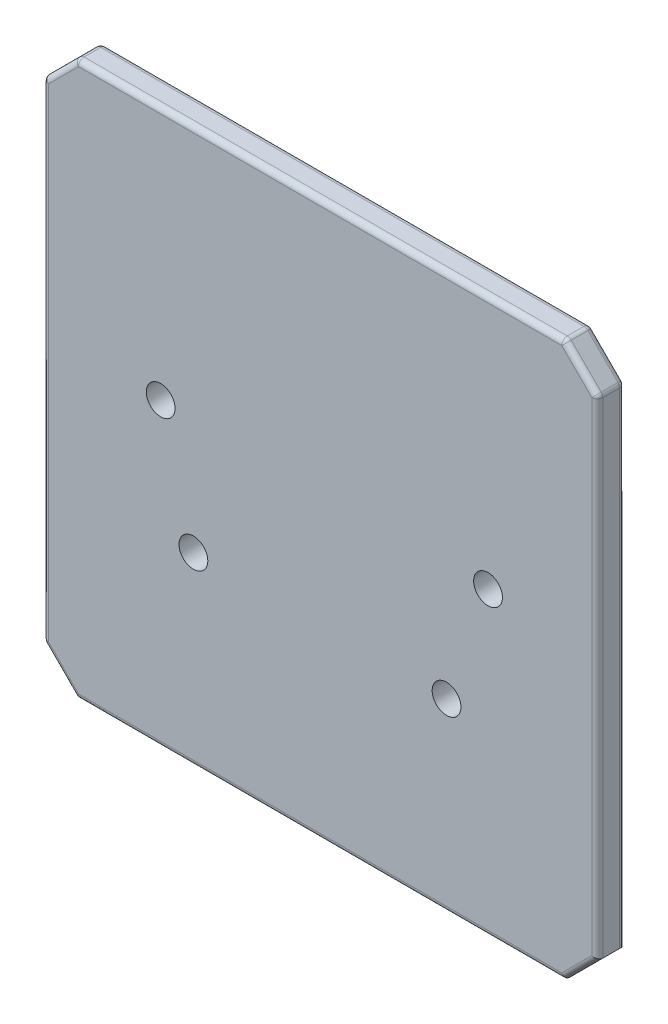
ISO-10303-21;
HEADER;
FILE_DESCRIPTION(('STEP AP214'),'2;1');
FILE_NAME('part.step','',(''),(''),'','','');
FILE_SCHEMA(('AUTOMOTIVE_DESIGN { 1 0 10303 214 1 1 1 1 }'));
ENDSEC;
DATA;
#1=APPLICATION_CONTEXT('core data for automotive mechanical design processes');
#2=APPLICATION_PROTOCOL_DEFINITION('international standard','automotive_design',2000,#1);
#3=PRODUCT_CONTEXT('',#1,'mechanical');
#4=PRODUCT('Part','Part','',(#3));
#5=PRODUCT_RELATED_PRODUCT_CATEGORY('part','',(#4));
#6=PRODUCT_DEFINITION_FORMATION('','',#4);
#7=PRODUCT_DEFINITION_CONTEXT('part definition',#1,'design');
#8=PRODUCT_DEFINITION('design','',#6,#7);
#9=PRODUCT_DEFINITION_SHAPE('','',#8);
#10=(LENGTH_UNIT() NAMED_UNIT(*) SI_UNIT(.MILLI.,.METRE.));
#11=(NAMED_UNIT(*) PLANE_ANGLE_UNIT() SI_UNIT($,.RADIAN.));
#12=(NAMED_UNIT(*) SI_UNIT($,.STERADIAN.) SOLID_ANGLE_UNIT());
#13=UNCERTAINTY_MEASURE_WITH_UNIT(LENGTH_MEASURE(1.E-05),#10,'distance_accuracy_value','');
#14=(GEOMETRIC_REPRESENTATION_CONTEXT(3) GLOBAL_UNCERTAINTY_ASSIGNED_CONTEXT((#13)) GLOBAL_UNIT_ASSIGNED_CONTEXT((#10,
#11,#12)) REPRESENTATION_CONTEXT('',''));
#15=CARTESIAN_POINT('',(0.,0.,0.));
#16=DIRECTION('',(0.,0.,1.));
#17=DIRECTION('',(1.,0.,0.));
#18=AXIS2_PLACEMENT_3D('',#15,#16,#17);
#19=CARTESIAN_POINT('',(-63.5,63.5,6.35));
#20=DIRECTION('',(0.,-1.,0.));
#21=DIRECTION('',(0.,0.,-1.));
#22=AXIS2_PLACEMENT_3D('',#19,#20,#21);
#23=PLANE('',#22);
#24=DIRECTION('',(-1.,0.,0.));
#25=VECTOR('',#24,1.);
#26=CARTESIAN_POINT('',(-63.5,63.5,1.27));
#27=LINE('',#26,#25);
#28=CARTESIAN_POINT('',(55.3539487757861,63.5,1.27));
#29=VERTEX_POINT('',#28);
#30=CARTESIAN_POINT('',(-55.3539487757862,63.5,1.27));
#31=VERTEX_POINT('',#30);
#32=EDGE_CURVE('E326',#29,#31,#27,.T.);
#33=ORIENTED_EDGE('',*,*,#32,.T.);
#34=DIRECTION('',(0.,0.,-1.));
#35=VECTOR('',#34,1.);
#36=CARTESIAN_POINT('',(-55.3539487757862,63.5,6.35));
#37=LINE('',#36,#35);
#38=CARTESIAN_POINT('',(-55.3539487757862,63.5,5.08));
#39=VERTEX_POINT('',#38);
#40=EDGE_CURVE('E332',#31,#39,#37,.F.);
#41=ORIENTED_EDGE('',*,*,#40,.T.);
#42=DIRECTION('',(-1.,0.,0.));
#43=VECTOR('',#42,1.);
#44=CARTESIAN_POINT('',(55.8799999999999,63.5,5.08));
#45=LINE('',#44,#43);
#46=CARTESIAN_POINT('',(55.3539487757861,63.5,5.08));
#47=VERTEX_POINT('',#46);
#48=EDGE_CURVE('E412',#39,#47,#45,.F.);
#49=ORIENTED_EDGE('',*,*,#48,.T.);
#50=DIRECTION('',(0.,0.,1.));
#51=VECTOR('',#50,1.);
#52=CARTESIAN_POINT('',(55.3539487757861,63.5,0.));
#53=LINE('',#52,#51);
#54=EDGE_CURVE('E334',#47,#29,#53,.F.);
#55=ORIENTED_EDGE('',*,*,#54,.T.);
#56=EDGE_LOOP('',(#33,#41,#49,#55));
#57=FACE_BOUND('',#56,.T.);
#58=ADVANCED_FACE('F33',(#57),#23,.F.);
#59=CARTESIAN_POINT('',(-63.5,-63.5,6.35));
#60=DIRECTION('',(1.,0.,0.));
#61=DIRECTION('',(0.,1.,0.));
#62=AXIS2_PLACEMENT_3D('',#59,#60,#61);
#63=PLANE('',#62);
#64=DIRECTION('',(0.,-1.,0.));
#65=VECTOR('',#64,1.);
#66=CARTESIAN_POINT('',(-63.5,55.8800000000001,5.08));
#67=LINE('',#66,#65);
#68=CARTESIAN_POINT('',(-63.5,-55.3539487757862,5.08));
#69=VERTEX_POINT('',#68);
#70=CARTESIAN_POINT('',(-63.5,55.3539487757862,5.08));
#71=VERTEX_POINT('',#70);
#72=EDGE_CURVE('E344',#69,#71,#67,.F.);
#73=ORIENTED_EDGE('',*,*,#72,.T.);
#74=DIRECTION('',(0.,0.,1.));
#75=VECTOR('',#74,1.);
#76=CARTESIAN_POINT('',(-63.5,55.3539487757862,1.27));
#77=LINE('',#76,#75);
#78=CARTESIAN_POINT('',(-63.5,55.3539487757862,1.27));
#79=VERTEX_POINT('',#78);
#80=EDGE_CURVE('E292',#71,#79,#77,.F.);
#81=ORIENTED_EDGE('',*,*,#80,.T.);
#82=DIRECTION('',(0.,-1.,0.));
#83=VECTOR('',#82,1.);
#84=CARTESIAN_POINT('',(-63.5,-63.5,1.27));
#85=LINE('',#84,#83);
#86=CARTESIAN_POINT('',(-63.5,-55.3539487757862,1.27));
#87=VERTEX_POINT('',#86);
#88=EDGE_CURVE('E352',#79,#87,#85,.T.);
#89=ORIENTED_EDGE('',*,*,#88,.T.);
#90=DIRECTION('',(0.,0.,-1.));
#91=VECTOR('',#90,1.);
#92=CARTESIAN_POINT('',(-63.5,-55.3539487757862,6.35));
#93=LINE('',#92,#91);
#94=EDGE_CURVE('E350',#87,#69,#93,.F.);
#95=ORIENTED_EDGE('',*,*,#94,.T.);
#96=EDGE_LOOP('',(#73,#81,#89,#95));
#97=FACE_BOUND('',#96,.T.);
#98=ADVANCED_FACE('F502',(#97),#63,.F.);
#99=CARTESIAN_POINT('',(-63.5,-63.5,6.35));
#100=DIRECTION('',(0.,1.,0.));
#101=DIRECTION('',(0.,0.,1.));
#102=AXIS2_PLACEMENT_3D('',#99,#100,#101);
#103=PLANE('',#102);
#104=DIRECTION('',(0.,0.,-1.));
#105=VECTOR('',#104,1.);
#106=CARTESIAN_POINT('',(-55.88,-63.5,6.35));
#107=LINE('',#106,#105);
#108=CARTESIAN_POINT('',(-55.88,-63.5,5.08));
#109=VERTEX_POINT('',#108);
#110=CARTESIAN_POINT('',(-55.88,-63.5,1.27));
#111=VERTEX_POINT('',#110);
#112=EDGE_CURVE('E198',#109,#111,#107,.T.);
#113=ORIENTED_EDGE('',*,*,#112,.T.);
#114=DIRECTION('',(1.,0.,0.));
#115=VECTOR('',#114,1.);
#116=CARTESIAN_POINT('',(-63.5,-63.5,1.27));
#117=LINE('',#116,#115);
#118=CARTESIAN_POINT('',(55.88,-63.5,1.27));
#119=VERTEX_POINT('',#118);
#120=EDGE_CURVE('E207',#111,#119,#117,.T.);
#121=ORIENTED_EDGE('',*,*,#120,.T.);
#122=DIRECTION('',(0.,0.,1.));
#123=VECTOR('',#122,1.);
#124=CARTESIAN_POINT('',(55.88,-63.5,6.35));
#125=LINE('',#124,#123);
#126=CARTESIAN_POINT('',(55.88,-63.5,5.08));
#127=VERTEX_POINT('',#126);
#128=EDGE_CURVE('E275',#119,#127,#125,.T.);
#129=ORIENTED_EDGE('',*,*,#128,.T.);
#130=DIRECTION('',(1.,0.,0.));
#131=VECTOR('',#130,1.);
#132=CARTESIAN_POINT('',(-55.88,-63.5,5.08));
#133=LINE('',#132,#131);
#134=EDGE_CURVE('E360',#127,#109,#133,.F.);
#135=ORIENTED_EDGE('',*,*,#134,.T.);
#136=EDGE_LOOP('',(#113,#121,#129,#135));
#137=FACE_BOUND('',#136,.T.);
#138=ADVANCED_FACE('F365',(#137),#103,.F.);
#139=CARTESIAN_POINT('',(63.5,-63.5,6.35));
#140=DIRECTION('',(-1.,0.,0.));
#141=DIRECTION('',(0.,-1.,0.));
#142=AXIS2_PLACEMENT_3D('',#139,#140,#141);
#143=PLANE('',#142);
#144=DIRECTION('',(0.,0.,-1.));
#145=VECTOR('',#144,1.);
#146=CARTESIAN_POINT('',(63.5,-55.88,6.35));
#147=LINE('',#146,#145);
#148=CARTESIAN_POINT('',(63.5,-55.88,5.08));
#149=VERTEX_POINT('',#148);
#150=CARTESIAN_POINT('',(63.5,-55.88,1.27));
#151=VERTEX_POINT('',#150);
#152=EDGE_CURVE('E188',#149,#151,#147,.T.);
#153=ORIENTED_EDGE('',*,*,#152,.T.);
#154=DIRECTION('',(0.,1.,0.));
#155=VECTOR('',#154,1.);
#156=CARTESIAN_POINT('',(63.5,-63.5,1.27));
#157=LINE('',#156,#155);
#158=CARTESIAN_POINT('',(63.5,55.3539487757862,1.27));
#159=VERTEX_POINT('',#158);
#160=EDGE_CURVE('E202',#151,#159,#157,.T.);
#161=ORIENTED_EDGE('',*,*,#160,.T.);
#162=DIRECTION('',(0.,0.,-1.));
#163=VECTOR('',#162,1.);
#164=CARTESIAN_POINT('',(63.5,55.3539487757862,6.35));
#165=LINE('',#164,#163);
#166=CARTESIAN_POINT('',(63.5,55.3539487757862,5.08));
#167=VERTEX_POINT('',#166);
#168=EDGE_CURVE('E394',#159,#167,#165,.F.);
#169=ORIENTED_EDGE('',*,*,#168,.T.);
#170=DIRECTION('',(0.,1.,0.));
#171=VECTOR('',#170,1.);
#172=CARTESIAN_POINT('',(63.5,-55.88,5.08));
#173=LINE('',#172,#171);
#174=EDGE_CURVE('E392',#167,#149,#173,.F.);
#175=ORIENTED_EDGE('',*,*,#174,.T.);
#176=EDGE_LOOP('',(#153,#161,#169,#175));
#177=FACE_BOUND('',#176,.T.);
#178=ADVANCED_FACE('F470',(#177),#143,.F.);
#179=CARTESIAN_POINT('',(63.5,63.5,6.35));
#180=DIRECTION('',(0.,0.,1.));
#181=DIRECTION('',(1.,0.,0.));
#182=AXIS2_PLACEMENT_3D('',#179,#180,#181);
#183=PLANE('',#182);
#184=CARTESIAN_POINT('',(-36.5368424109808,5.45243944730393,6.35));
#185=DIRECTION('',(0.,0.,1.));
#186=DIRECTION('',(1.,0.,0.));
#187=AXIS2_PLACEMENT_3D('',#184,#185,#186);
#188=CIRCLE('',#187,3.3);
#189=CARTESIAN_POINT('',(-33.2368424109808,5.45243944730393,6.35));
#190=VERTEX_POINT('',#189);
#191=EDGE_CURVE('E452',#190,#190,#188,.T.);
#192=ORIENTED_EDGE('',*,*,#191,.F.);
#193=EDGE_LOOP('',(#192));
#194=FACE_BOUND('',#193,.T.);
#195=CARTESIAN_POINT('',(38.4631575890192,5.45243944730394,6.35));
#196=DIRECTION('',(0.,0.,1.));
#197=DIRECTION('',(1.,0.,0.));
#198=AXIS2_PLACEMENT_3D('',#195,#196,#197);
#199=CIRCLE('',#198,3.3);
#200=CARTESIAN_POINT('',(41.7631575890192,5.45243944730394,6.35));
#201=VERTEX_POINT('',#200);
#202=EDGE_CURVE('E446',#201,#201,#199,.T.);
#203=ORIENTED_EDGE('',*,*,#202,.F.);
#204=EDGE_LOOP('',(#203));
#205=FACE_BOUND('',#204,.T.);
#206=CARTESIAN_POINT('',(28.9631575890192,-21.0468662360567,6.35));
#207=DIRECTION('',(0.,0.,1.));
#208=DIRECTION('',(1.,0.,0.));
#209=AXIS2_PLACEMENT_3D('',#206,#207,#208);
#210=CIRCLE('',#209,3.3);
#211=CARTESIAN_POINT('',(32.2631575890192,-21.0468662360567,6.35));
#212=VERTEX_POINT('',#211);
#213=EDGE_CURVE('E440',#212,#212,#210,.T.);
#214=ORIENTED_EDGE('',*,*,#213,.F.);
#215=EDGE_LOOP('',(#214));
#216=FACE_BOUND('',#215,.T.);
#217=CARTESIAN_POINT('',(-29.0368424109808,-21.0468662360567,6.35));
#218=DIRECTION('',(0.,0.,1.));
#219=DIRECTION('',(1.,0.,0.));
#220=AXIS2_PLACEMENT_3D('',#217,#218,#219);
#221=CIRCLE('',#220,3.3);
#222=CARTESIAN_POINT('',(-25.7368424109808,-21.0468662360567,6.35));
#223=VERTEX_POINT('',#222);
#224=EDGE_CURVE('E434',#223,#223,#221,.T.);
#225=ORIENTED_EDGE('',*,*,#224,.F.);
#226=EDGE_LOOP('',(#225));
#227=FACE_BOUND('',#226,.T.);
#228=DIRECTION('',(-1.,0.,0.));
#229=VECTOR('',#228,1.);
#230=CARTESIAN_POINT('',(-55.88,62.23,6.35));
#231=LINE('',#230,#229);
#232=CARTESIAN_POINT('',(55.3539487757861,62.23,6.35));
#233=VERTEX_POINT('',#232);
#234=CARTESIAN_POINT('',(-55.3539487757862,62.23,6.35));
#235=VERTEX_POINT('',#234);
#236=EDGE_CURVE('E409',#233,#235,#231,.T.);
#237=ORIENTED_EDGE('',*,*,#236,.T.);
#238=DIRECTION('',(0.707106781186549,0.707106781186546,0.));
#239=VECTOR('',#238,1.);
#240=CARTESIAN_POINT('',(4.70802561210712,122.291974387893,6.35));
#241=LINE('',#240,#239);
#242=CARTESIAN_POINT('',(-62.23,55.3539487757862,6.35));
#243=VERTEX_POINT('',#242);
#244=EDGE_CURVE('E282',#235,#243,#241,.F.);
#245=ORIENTED_EDGE('',*,*,#244,.T.);
#246=DIRECTION('',(0.,-1.,0.));
#247=VECTOR('',#246,1.);
#248=CARTESIAN_POINT('',(-62.23,-55.88,6.35));
#249=LINE('',#248,#247);
#250=CARTESIAN_POINT('',(-62.23,-55.3539487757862,6.35));
#251=VERTEX_POINT('',#250);
#252=EDGE_CURVE('E397',#243,#251,#249,.T.);
#253=ORIENTED_EDGE('',*,*,#252,.T.);
#254=DIRECTION('',(-0.707106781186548,0.707106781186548,0.));
#255=VECTOR('',#254,1.);
#256=CARTESIAN_POINT('',(-58.7919743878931,-58.7919743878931,6.35));
#257=LINE('',#256,#255);
#258=CARTESIAN_POINT('',(-55.3539487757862,-62.23,6.35));
#259=VERTEX_POINT('',#258);
#260=EDGE_CURVE('E399',#251,#259,#257,.F.);
#261=ORIENTED_EDGE('',*,*,#260,.T.);
#262=DIRECTION('',(1.,0.,0.));
#263=VECTOR('',#262,1.);
#264=CARTESIAN_POINT('',(55.88,-62.23,6.35));
#265=LINE('',#264,#263);
#266=CARTESIAN_POINT('',(55.3539487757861,-62.23,6.35));
#267=VERTEX_POINT('',#266);
#268=EDGE_CURVE('E401',#259,#267,#265,.T.);
#269=ORIENTED_EDGE('',*,*,#268,.T.);
#270=DIRECTION('',(-0.707106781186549,-0.707106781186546,0.));
#271=VECTOR('',#270,1.);
#272=CARTESIAN_POINT('',(122.291974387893,4.7080256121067,6.35));
#273=LINE('',#272,#271);
#274=CARTESIAN_POINT('',(62.23,-55.3539487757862,6.35));
#275=VERTEX_POINT('',#274);
#276=EDGE_CURVE('E403',#267,#275,#273,.F.);
#277=ORIENTED_EDGE('',*,*,#276,.T.);
#278=DIRECTION('',(0.,1.,0.));
#279=VECTOR('',#278,1.);
#280=CARTESIAN_POINT('',(62.23,55.88,6.35));
#281=LINE('',#280,#279);
#282=CARTESIAN_POINT('',(62.23,55.3539487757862,6.35));
#283=VERTEX_POINT('',#282);
#284=EDGE_CURVE('E405',#275,#283,#281,.T.);
#285=ORIENTED_EDGE('',*,*,#284,.T.);
#286=DIRECTION('',(0.707106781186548,-0.707106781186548,0.));
#287=VECTOR('',#286,1.);
#288=CARTESIAN_POINT('',(58.7919743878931,58.7919743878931,6.35));
#289=LINE('',#288,#287);
#290=EDGE_CURVE('E407',#283,#233,#289,.F.);
#291=ORIENTED_EDGE('',*,*,#290,.T.);
#292=EDGE_LOOP('',(#237,#245,#253,#261,#269,#277,#285,#291));
#293=FACE_BOUND('',#292,.T.);
#294=ADVANCED_FACE('F467',(#194,#205,#216,#227,#293),#183,.T.);
#295=CARTESIAN_POINT('',(63.5,63.5,0.));
#296=DIRECTION('',(0.,0.,1.));
#297=DIRECTION('',(1.,0.,0.));
#298=AXIS2_PLACEMENT_3D('',#295,#296,#297);
#299=PLANE('',#298);
#300=CARTESIAN_POINT('',(-36.5368424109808,5.45243944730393,0.));
#301=DIRECTION('',(0.,0.,1.));
#302=DIRECTION('',(1.,0.,0.));
#303=AXIS2_PLACEMENT_3D('',#300,#301,#302);
#304=CIRCLE('',#303,3.3);
#305=CARTESIAN_POINT('',(-33.2368424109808,5.45243944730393,0.));
#306=VERTEX_POINT('',#305);
#307=EDGE_CURVE('E449',#306,#306,#304,.T.);
#308=ORIENTED_EDGE('',*,*,#307,.T.);
#309=EDGE_LOOP('',(#308));
#310=FACE_BOUND('',#309,.T.);
#311=CARTESIAN_POINT('',(38.4631575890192,5.45243944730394,0.));
#312=DIRECTION('',(0.,0.,1.));
#313=DIRECTION('',(1.,0.,0.));
#314=AXIS2_PLACEMENT_3D('',#311,#312,#313);
#315=CIRCLE('',#314,3.3);
#316=CARTESIAN_POINT('',(41.7631575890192,5.45243944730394,0.));
#317=VERTEX_POINT('',#316);
#318=EDGE_CURVE('E443',#317,#317,#315,.T.);
#319=ORIENTED_EDGE('',*,*,#318,.T.);
#320=EDGE_LOOP('',(#319));
#321=FACE_BOUND('',#320,.T.);
#322=CARTESIAN_POINT('',(28.9631575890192,-21.0468662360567,0.));
#323=DIRECTION('',(0.,0.,1.));
#324=DIRECTION('',(1.,0.,0.));
#325=AXIS2_PLACEMENT_3D('',#322,#323,#324);
#326=CIRCLE('',#325,3.3);
#327=CARTESIAN_POINT('',(32.2631575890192,-21.0468662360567,0.));
#328=VERTEX_POINT('',#327);
#329=EDGE_CURVE('E437',#328,#328,#326,.T.);
#330=ORIENTED_EDGE('',*,*,#329,.T.);
#331=EDGE_LOOP('',(#330));
#332=FACE_BOUND('',#331,.T.);
#333=CARTESIAN_POINT('',(-29.0368424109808,-21.0468662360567,0.));
#334=DIRECTION('',(0.,0.,1.));
#335=DIRECTION('',(1.,0.,0.));
#336=AXIS2_PLACEMENT_3D('',#333,#334,#335);
#337=CIRCLE('',#336,3.3);
#338=CARTESIAN_POINT('',(-25.7368424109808,-21.0468662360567,0.));
#339=VERTEX_POINT('',#338);
#340=EDGE_CURVE('E300',#339,#339,#337,.T.);
#341=ORIENTED_EDGE('',*,*,#340,.T.);
#342=EDGE_LOOP('',(#341));
#343=FACE_BOUND('',#342,.T.);
#344=DIRECTION('',(0.,-1.,0.));
#345=VECTOR('',#344,1.);
#346=CARTESIAN_POINT('',(-62.23,63.5,0.));
#347=LINE('',#346,#345);
#348=CARTESIAN_POINT('',(-62.23,-55.3539487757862,0.));
#349=VERTEX_POINT('',#348);
#350=CARTESIAN_POINT('',(-62.23,55.3539487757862,0.));
#351=VERTEX_POINT('',#350);
#352=EDGE_CURVE('E377',#349,#351,#347,.F.);
#353=ORIENTED_EDGE('',*,*,#352,.T.);
#354=DIRECTION('',(-0.707106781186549,-0.707106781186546,0.));
#355=VECTOR('',#354,1.);
#356=CARTESIAN_POINT('',(-56.2519743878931,61.3319743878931,0.));
#357=LINE('',#356,#355);
#358=CARTESIAN_POINT('',(-55.3539487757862,62.23,0.));
#359=VERTEX_POINT('',#358);
#360=EDGE_CURVE('E11',#351,#359,#357,.F.);
#361=ORIENTED_EDGE('',*,*,#360,.T.);
#362=DIRECTION('',(-1.,0.,0.));
#363=VECTOR('',#362,1.);
#364=CARTESIAN_POINT('',(63.5,62.23,0.));
#365=LINE('',#364,#363);
#366=CARTESIAN_POINT('',(55.3539487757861,62.23,0.));
#367=VERTEX_POINT('',#366);
#368=EDGE_CURVE('E328',#359,#367,#365,.F.);
#369=ORIENTED_EDGE('',*,*,#368,.T.);
#370=DIRECTION('',(-0.707106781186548,0.707106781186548,0.));
#371=VECTOR('',#370,1.);
#372=CARTESIAN_POINT('',(62.6019743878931,54.9819743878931,0.));
#373=LINE('',#372,#371);
#374=CARTESIAN_POINT('',(62.23,55.3539487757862,0.));
#375=VERTEX_POINT('',#374);
#376=EDGE_CURVE('E184',#367,#375,#373,.F.);
#377=ORIENTED_EDGE('',*,*,#376,.T.);
#378=DIRECTION('',(0.,1.,0.));
#379=VECTOR('',#378,1.);
#380=CARTESIAN_POINT('',(62.23,63.5,0.));
#381=LINE('',#380,#379);
#382=CARTESIAN_POINT('',(62.23,-57.15,0.));
#383=VERTEX_POINT('',#382);
#384=EDGE_CURVE('E178',#375,#383,#381,.F.);
#385=ORIENTED_EDGE('',*,*,#384,.T.);
#386=DIRECTION('',(0.707106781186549,0.707106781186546,0.));
#387=VECTOR('',#386,1.);
#388=CARTESIAN_POINT('',(63.5,-55.88,0.));
#389=LINE('',#388,#387);
#390=CARTESIAN_POINT('',(57.15,-62.23,0.));
#391=VERTEX_POINT('',#390);
#392=EDGE_CURVE('E181',#383,#391,#389,.F.);
#393=ORIENTED_EDGE('',*,*,#392,.T.);
#394=DIRECTION('',(1.,0.,0.));
#395=VECTOR('',#394,1.);
#396=CARTESIAN_POINT('',(63.5,-62.23,0.));
#397=LINE('',#396,#395);
#398=CARTESIAN_POINT('',(-55.3539487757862,-62.23,0.));
#399=VERTEX_POINT('',#398);
#400=EDGE_CURVE('E373',#391,#399,#397,.F.);
#401=ORIENTED_EDGE('',*,*,#400,.T.);
#402=DIRECTION('',(0.707106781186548,-0.707106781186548,0.));
#403=VECTOR('',#402,1.);
#404=CARTESIAN_POINT('',(-62.6019743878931,-54.9819743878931,0.));
#405=LINE('',#404,#403);
#406=EDGE_CURVE('E375',#399,#349,#405,.F.);
#407=ORIENTED_EDGE('',*,*,#406,.T.);
#408=EDGE_LOOP('',(#353,#361,#369,#377,#385,#393,#401,#407));
#409=FACE_BOUND('',#408,.T.);
#410=ADVANCED_FACE('F180',(#310,#321,#332,#343,#409),#299,.F.);
#411=CARTESIAN_POINT('',(-55.88,-63.5,6.35));
#412=DIRECTION('',(0.707106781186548,0.707106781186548,0.));
#413=DIRECTION('',(-0.707106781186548,0.707106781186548,0.));
#414=AXIS2_PLACEMENT_3D('',#411,#412,#413);
#415=PLANE('',#414);
#416=DIRECTION('',(0.,0.,1.));
#417=VECTOR('',#416,1.);
#418=CARTESIAN_POINT('',(-63.1280256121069,-56.2519743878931,0.));
#419=LINE('',#418,#417);
#420=CARTESIAN_POINT('',(-63.1280256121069,-56.2519743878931,5.08));
#421=VERTEX_POINT('',#420);
#422=CARTESIAN_POINT('',(-63.1280256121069,-56.2519743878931,1.27));
#423=VERTEX_POINT('',#422);
#424=EDGE_CURVE('E356',#421,#423,#419,.F.);
#425=ORIENTED_EDGE('',*,*,#424,.T.);
#426=DIRECTION('',(-0.707106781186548,0.707106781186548,0.));
#427=VECTOR('',#426,1.);
#428=CARTESIAN_POINT('',(-55.88,-63.5,1.27));
#429=LINE('',#428,#427);
#430=EDGE_CURVE('E358',#423,#111,#429,.F.);
#431=ORIENTED_EDGE('',*,*,#430,.T.);
#432=ORIENTED_EDGE('',*,*,#112,.F.);
#433=DIRECTION('',(0.707106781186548,-0.707106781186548,0.));
#434=VECTOR('',#433,1.);
#435=CARTESIAN_POINT('',(-55.88,-63.5,5.08));
#436=LINE('',#435,#434);
#437=EDGE_CURVE('E354',#109,#421,#436,.F.);
#438=ORIENTED_EDGE('',*,*,#437,.T.);
#439=EDGE_LOOP('',(#425,#431,#432,#438));
#440=FACE_BOUND('',#439,.T.);
#441=ADVANCED_FACE('F511',(#440),#415,.F.);
#442=CARTESIAN_POINT('',(63.5,-55.88,6.35));
#443=DIRECTION('',(-0.707106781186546,0.707106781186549,0.));
#444=DIRECTION('',(-0.707106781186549,-0.707106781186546,0.));
#445=AXIS2_PLACEMENT_3D('',#442,#443,#444);
#446=PLANE('',#445);
#447=ORIENTED_EDGE('',*,*,#128,.F.);
#448=CARTESIAN_POINT('',(57.15,-62.23,1.27));
#449=DIRECTION('',(-0.707106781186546,0.707106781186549,0.));
#450=DIRECTION('',(0.707106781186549,0.707106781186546,0.));
#451=AXIS2_PLACEMENT_3D('',#448,#449,#450);
#452=ELLIPSE('',#451,1.79605122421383,1.27);
#453=EDGE_CURVE('E197',#119,#391,#452,.F.);
#454=ORIENTED_EDGE('',*,*,#453,.T.);
#455=ORIENTED_EDGE('',*,*,#392,.F.);
#456=CARTESIAN_POINT('',(62.23,-57.15,1.27));
#457=DIRECTION('',(-0.707106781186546,0.707106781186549,0.));
#458=DIRECTION('',(0.707106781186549,0.707106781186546,0.));
#459=AXIS2_PLACEMENT_3D('',#456,#457,#458);
#460=ELLIPSE('',#459,1.79605122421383,1.27);
#461=EDGE_CURVE('E194',#383,#151,#460,.F.);
#462=ORIENTED_EDGE('',*,*,#461,.T.);
#463=ORIENTED_EDGE('',*,*,#152,.F.);
#464=DIRECTION('',(0.707106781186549,0.707106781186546,0.));
#465=VECTOR('',#464,1.);
#466=CARTESIAN_POINT('',(63.5,-55.88,5.08));
#467=LINE('',#466,#465);
#468=EDGE_CURVE('E203',#149,#127,#467,.F.);
#469=ORIENTED_EDGE('',*,*,#468,.T.);
#470=EDGE_LOOP('',(#447,#454,#455,#462,#463,#469));
#471=FACE_BOUND('',#470,.T.);
#472=ADVANCED_FACE('F192',(#471),#446,.F.);
#473=CARTESIAN_POINT('',(55.88,63.5,6.35));
#474=DIRECTION('',(-0.707106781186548,-0.707106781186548,0.));
#475=DIRECTION('',(0.707106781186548,-0.707106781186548,0.));
#476=AXIS2_PLACEMENT_3D('',#473,#474,#475);
#477=PLANE('',#476);
#478=DIRECTION('',(0.,0.,1.));
#479=VECTOR('',#478,1.);
#480=CARTESIAN_POINT('',(63.1280256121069,56.2519743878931,0.));
#481=LINE('',#480,#479);
#482=CARTESIAN_POINT('',(63.1280256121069,56.2519743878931,5.08));
#483=VERTEX_POINT('',#482);
#484=CARTESIAN_POINT('',(63.1280256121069,56.2519743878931,1.27));
#485=VERTEX_POINT('',#484);
#486=EDGE_CURVE('E387',#483,#485,#481,.F.);
#487=ORIENTED_EDGE('',*,*,#486,.T.);
#488=DIRECTION('',(0.707106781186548,-0.707106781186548,0.));
#489=VECTOR('',#488,1.);
#490=CARTESIAN_POINT('',(55.88,63.5,1.27));
#491=LINE('',#490,#489);
#492=CARTESIAN_POINT('',(56.2519743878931,63.1280256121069,1.27));
#493=VERTEX_POINT('',#492);
#494=EDGE_CURVE('E389',#485,#493,#491,.F.);
#495=ORIENTED_EDGE('',*,*,#494,.T.);
#496=DIRECTION('',(0.,0.,-1.));
#497=VECTOR('',#496,1.);
#498=CARTESIAN_POINT('',(56.2519743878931,63.1280256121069,6.35));
#499=LINE('',#498,#497);
#500=CARTESIAN_POINT('',(56.2519743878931,63.1280256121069,5.08));
#501=VERTEX_POINT('',#500);
#502=EDGE_CURVE('E383',#493,#501,#499,.F.);
#503=ORIENTED_EDGE('',*,*,#502,.T.);
#504=DIRECTION('',(-0.707106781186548,0.707106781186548,0.));
#505=VECTOR('',#504,1.);
#506=CARTESIAN_POINT('',(55.88,63.5,5.08));
#507=LINE('',#506,#505);
#508=EDGE_CURVE('E385',#501,#483,#507,.F.);
#509=ORIENTED_EDGE('',*,*,#508,.T.);
#510=EDGE_LOOP('',(#487,#495,#503,#509));
#511=FACE_BOUND('',#510,.T.);
#512=ADVANCED_FACE('F517',(#511),#477,.F.);
#513=CARTESIAN_POINT('',(-63.5,55.8800000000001,6.35));
#514=DIRECTION('',(0.707106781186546,-0.707106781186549,0.));
#515=DIRECTION('',(0.707106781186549,0.707106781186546,0.));
#516=AXIS2_PLACEMENT_3D('',#513,#514,#515);
#517=PLANE('',#516);
#518=DIRECTION('',(0.,0.,-1.));
#519=VECTOR('',#518,1.);
#520=CARTESIAN_POINT('',(-63.1280256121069,56.2519743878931,5.08));
#521=LINE('',#520,#519);
#522=CARTESIAN_POINT('',(-63.1280256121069,56.2519743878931,1.27));
#523=VERTEX_POINT('',#522);
#524=CARTESIAN_POINT('',(-63.1280256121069,56.2519743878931,5.08));
#525=VERTEX_POINT('',#524);
#526=EDGE_CURVE('E286',#523,#525,#521,.F.);
#527=ORIENTED_EDGE('',*,*,#526,.T.);
#528=DIRECTION('',(-0.707106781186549,-0.707106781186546,0.));
#529=VECTOR('',#528,1.);
#530=CARTESIAN_POINT('',(-63.5,55.8800000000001,5.08));
#531=LINE('',#530,#529);
#532=CARTESIAN_POINT('',(-56.2519743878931,63.1280256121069,5.08));
#533=VERTEX_POINT('',#532);
#534=EDGE_CURVE('E288',#525,#533,#531,.F.);
#535=ORIENTED_EDGE('',*,*,#534,.T.);
#536=DIRECTION('',(0.,0.,1.));
#537=VECTOR('',#536,1.);
#538=CARTESIAN_POINT('',(-56.2519743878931,63.1280256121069,0.));
#539=LINE('',#538,#537);
#540=CARTESIAN_POINT('',(-56.2519743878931,63.1280256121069,1.27));
#541=VERTEX_POINT('',#540);
#542=EDGE_CURVE('E342',#533,#541,#539,.F.);
#543=ORIENTED_EDGE('',*,*,#542,.T.);
#544=DIRECTION('',(0.707106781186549,0.707106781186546,0.));
#545=VECTOR('',#544,1.);
#546=CARTESIAN_POINT('',(-62.23,57.15,1.27));
#547=LINE('',#546,#545);
#548=EDGE_CURVE('E284',#541,#523,#547,.F.);
#549=ORIENTED_EDGE('',*,*,#548,.T.);
#550=EDGE_LOOP('',(#527,#535,#543,#549));
#551=FACE_BOUND('',#550,.T.);
#552=ADVANCED_FACE('F520',(#551),#517,.F.);
#553=CARTESIAN_POINT('',(-63.5,-62.23,1.27));
#554=DIRECTION('',(1.,0.,0.));
#555=DIRECTION('',(0.,0.,-1.));
#556=AXIS2_PLACEMENT_3D('',#553,#554,#555);
#557=CYLINDRICAL_SURFACE('',#556,1.27);
#558=ORIENTED_EDGE('',*,*,#453,.F.);
#559=ORIENTED_EDGE('',*,*,#120,.F.);
#560=CARTESIAN_POINT('',(-55.3539487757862,-62.23,1.27));
#561=DIRECTION('',(0.923879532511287,-0.38268343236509,0.));
#562=DIRECTION('',(0.38268343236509,0.923879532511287,0.));
#563=AXIS2_PLACEMENT_3D('',#560,#561,#562);
#564=ELLIPSE('',#563,1.37463809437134,1.27);
#565=EDGE_CURVE('E272',#399,#111,#564,.F.);
#566=ORIENTED_EDGE('',*,*,#565,.F.);
#567=ORIENTED_EDGE('',*,*,#400,.F.);
#568=EDGE_LOOP('',(#558,#559,#566,#567));
#569=FACE_BOUND('',#568,.T.);
#570=ADVANCED_FACE('F372',(#569),#557,.T.);
#571=CARTESIAN_POINT('',(-58.7919743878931,-58.7919743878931,1.27));
#572=DIRECTION('',(-0.707106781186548,0.707106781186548,0.));
#573=DIRECTION('',(-0.707106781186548,-0.707106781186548,0.));
#574=AXIS2_PLACEMENT_3D('',#571,#572,#573);
#575=CYLINDRICAL_SURFACE('',#574,1.27);
#576=ORIENTED_EDGE('',*,*,#565,.T.);
#577=ORIENTED_EDGE('',*,*,#430,.F.);
#578=CARTESIAN_POINT('',(-62.23,-55.3539487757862,1.27));
#579=DIRECTION('',(-0.707106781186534,0.707106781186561,0.));
#580=DIRECTION('',(-0.707106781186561,-0.707106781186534,0.));
#581=AXIS2_PLACEMENT_3D('',#578,#579,#580);
#582=CIRCLE('',#581,1.27);
#583=EDGE_CURVE('E269',#349,#423,#582,.T.);
#584=ORIENTED_EDGE('',*,*,#583,.F.);
#585=ORIENTED_EDGE('',*,*,#406,.F.);
#586=EDGE_LOOP('',(#576,#577,#584,#585));
#587=FACE_BOUND('',#586,.T.);
#588=ADVANCED_FACE('F592',(#587),#575,.T.);
#589=CARTESIAN_POINT('',(-62.23,-63.5,1.27));
#590=DIRECTION('',(0.,-1.,0.));
#591=DIRECTION('',(1.,0.,0.));
#592=AXIS2_PLACEMENT_3D('',#589,#590,#591);
#593=CYLINDRICAL_SURFACE('',#592,1.27);
#594=ORIENTED_EDGE('',*,*,#88,.F.);
#595=CARTESIAN_POINT('',(-62.23,55.3539487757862,1.27));
#596=DIRECTION('',(0.,-1.,0.));
#597=DIRECTION('',(1.,0.,0.));
#598=AXIS2_PLACEMENT_3D('',#595,#596,#597);
#599=CIRCLE('',#598,1.27);
#600=EDGE_CURVE('E56',#79,#351,#599,.T.);
#601=ORIENTED_EDGE('',*,*,#600,.T.);
#602=ORIENTED_EDGE('',*,*,#352,.F.);
#603=CARTESIAN_POINT('',(-62.23,-55.3539487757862,1.27));
#604=DIRECTION('',(0.,-1.,0.));
#605=DIRECTION('',(0.,0.,-1.));
#606=AXIS2_PLACEMENT_3D('',#603,#604,#605);
#607=CIRCLE('',#606,1.27);
#608=EDGE_CURVE('E266',#87,#349,#607,.T.);
#609=ORIENTED_EDGE('',*,*,#608,.F.);
#610=EDGE_LOOP('',(#594,#601,#602,#609));
#611=FACE_BOUND('',#610,.T.);
#612=ADVANCED_FACE('F588',(#611),#593,.T.);
#613=CARTESIAN_POINT('',(-62.23,-55.3539487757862,1.27));
#614=DIRECTION('',(0.,0.,1.));
#615=DIRECTION('',(1.,0.,0.));
#616=AXIS2_PLACEMENT_3D('',#613,#614,#615);
#617=SPHERICAL_SURFACE('',#616,1.27);
#618=ORIENTED_EDGE('',*,*,#608,.T.);
#619=ORIENTED_EDGE('',*,*,#583,.T.);
#620=CARTESIAN_POINT('',(-62.23,-55.3539487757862,1.27));
#621=DIRECTION('',(0.,0.,-1.));
#622=DIRECTION('',(-1.,0.,0.));
#623=AXIS2_PLACEMENT_3D('',#620,#621,#622);
#624=CIRCLE('',#623,1.27);
#625=EDGE_CURVE('E263',#87,#423,#624,.F.);
#626=ORIENTED_EDGE('',*,*,#625,.F.);
#627=EDGE_LOOP('',(#618,#619,#626));
#628=FACE_BOUND('',#627,.T.);
#629=ADVANCED_FACE('F584',(#628),#617,.T.);
#630=CARTESIAN_POINT('',(-62.23,-55.3539487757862,6.35));
#631=DIRECTION('',(0.,0.,1.));
#632=DIRECTION('',(1.,0.,0.));
#633=AXIS2_PLACEMENT_3D('',#630,#631,#632);
#634=CYLINDRICAL_SURFACE('',#633,1.27);
#635=ORIENTED_EDGE('',*,*,#625,.T.);
#636=ORIENTED_EDGE('',*,*,#424,.F.);
#637=CARTESIAN_POINT('',(-62.23,-55.3539487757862,5.08));
#638=DIRECTION('',(0.,0.,1.));
#639=DIRECTION('',(1.,0.,0.));
#640=AXIS2_PLACEMENT_3D('',#637,#638,#639);
#641=CIRCLE('',#640,1.27);
#642=EDGE_CURVE('E260',#69,#421,#641,.T.);
#643=ORIENTED_EDGE('',*,*,#642,.F.);
#644=ORIENTED_EDGE('',*,*,#94,.F.);
#645=EDGE_LOOP('',(#635,#636,#643,#644));
#646=FACE_BOUND('',#645,.T.);
#647=ADVANCED_FACE('F580',(#646),#634,.T.);
#648=CARTESIAN_POINT('',(-62.23,63.5,5.08));
#649=DIRECTION('',(0.,1.,0.));
#650=DIRECTION('',(-1.,0.,0.));
#651=AXIS2_PLACEMENT_3D('',#648,#649,#650);
#652=CYLINDRICAL_SURFACE('',#651,1.27);
#653=ORIENTED_EDGE('',*,*,#252,.F.);
#654=CARTESIAN_POINT('',(-62.23,55.3539487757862,5.08));
#655=DIRECTION('',(0.,1.,0.));
#656=DIRECTION('',(-1.,0.,0.));
#657=AXIS2_PLACEMENT_3D('',#654,#655,#656);
#658=CIRCLE('',#657,1.27);
#659=EDGE_CURVE('E290',#243,#71,#658,.F.);
#660=ORIENTED_EDGE('',*,*,#659,.T.);
#661=ORIENTED_EDGE('',*,*,#72,.F.);
#662=CARTESIAN_POINT('',(-62.23,-55.3539487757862,5.08));
#663=DIRECTION('',(0.,-1.,0.));
#664=DIRECTION('',(1.,0.,0.));
#665=AXIS2_PLACEMENT_3D('',#662,#663,#664);
#666=CIRCLE('',#665,1.27);
#667=EDGE_CURVE('E257',#251,#69,#666,.T.);
#668=ORIENTED_EDGE('',*,*,#667,.F.);
#669=EDGE_LOOP('',(#653,#660,#661,#668));
#670=FACE_BOUND('',#669,.T.);
#671=ADVANCED_FACE('F576',(#670),#652,.T.);
#672=CARTESIAN_POINT('',(-62.23,-55.3539487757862,5.08));
#673=DIRECTION('',(0.,0.,1.));
#674=DIRECTION('',(1.,0.,0.));
#675=AXIS2_PLACEMENT_3D('',#672,#673,#674);
#676=SPHERICAL_SURFACE('',#675,1.27);
#677=ORIENTED_EDGE('',*,*,#667,.T.);
#678=ORIENTED_EDGE('',*,*,#642,.T.);
#679=CARTESIAN_POINT('',(-62.23,-55.3539487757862,5.08));
#680=DIRECTION('',(-0.707106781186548,0.707106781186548,0.));
#681=DIRECTION('',(-0.707106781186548,-0.707106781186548,0.));
#682=AXIS2_PLACEMENT_3D('',#679,#680,#681);
#683=CIRCLE('',#682,1.27);
#684=EDGE_CURVE('E254',#251,#421,#683,.F.);
#685=ORIENTED_EDGE('',*,*,#684,.F.);
#686=EDGE_LOOP('',(#677,#678,#685));
#687=FACE_BOUND('',#686,.T.);
#688=ADVANCED_FACE('F572',(#687),#676,.T.);
#689=CARTESIAN_POINT('',(-58.7919743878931,-58.7919743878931,5.08));
#690=DIRECTION('',(-0.707106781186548,0.707106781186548,0.));
#691=DIRECTION('',(-0.707106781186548,-0.707106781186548,0.));
#692=AXIS2_PLACEMENT_3D('',#689,#690,#691);
#693=CYLINDRICAL_SURFACE('',#692,1.27);
#694=ORIENTED_EDGE('',*,*,#684,.T.);
#695=ORIENTED_EDGE('',*,*,#437,.F.);
#696=CARTESIAN_POINT('',(-55.3539487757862,-62.23,5.08));
#697=DIRECTION('',(-0.923879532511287,0.38268343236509,0.));
#698=DIRECTION('',(0.38268343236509,0.923879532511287,0.));
#699=AXIS2_PLACEMENT_3D('',#696,#697,#698);
#700=ELLIPSE('',#699,1.37463809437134,1.27);
#701=EDGE_CURVE('E251',#259,#109,#700,.F.);
#702=ORIENTED_EDGE('',*,*,#701,.F.);
#703=ORIENTED_EDGE('',*,*,#260,.F.);
#704=EDGE_LOOP('',(#694,#695,#702,#703));
#705=FACE_BOUND('',#704,.T.);
#706=ADVANCED_FACE('F568',(#705),#693,.T.);
#707=CARTESIAN_POINT('',(63.5,-62.23,5.08));
#708=DIRECTION('',(-1.,0.,0.));
#709=DIRECTION('',(0.,0.,1.));
#710=AXIS2_PLACEMENT_3D('',#707,#708,#709);
#711=CYLINDRICAL_SURFACE('',#710,1.27);
#712=ORIENTED_EDGE('',*,*,#701,.T.);
#713=ORIENTED_EDGE('',*,*,#134,.F.);
#714=CARTESIAN_POINT('',(55.3539487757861,-62.23,5.08));
#715=DIRECTION('',(-0.923879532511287,-0.382683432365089,0.));
#716=DIRECTION('',(-0.382683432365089,0.923879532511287,0.));
#717=AXIS2_PLACEMENT_3D('',#714,#715,#716);
#718=ELLIPSE('',#717,1.37463809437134,1.27);
#719=EDGE_CURVE('E248',#267,#127,#718,.F.);
#720=ORIENTED_EDGE('',*,*,#719,.F.);
#721=ORIENTED_EDGE('',*,*,#268,.F.);
#722=EDGE_LOOP('',(#712,#713,#720,#721));
#723=FACE_BOUND('',#722,.T.);
#724=ADVANCED_FACE('F564',(#723),#711,.T.);
#725=CARTESIAN_POINT('',(122.291974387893,4.7080256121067,5.08));
#726=DIRECTION('',(-0.707106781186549,-0.707106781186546,0.));
#727=DIRECTION('',(0.707106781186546,-0.707106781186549,0.));
#728=AXIS2_PLACEMENT_3D('',#725,#726,#727);
#729=CYLINDRICAL_SURFACE('',#728,1.27);
#730=ORIENTED_EDGE('',*,*,#719,.T.);
#731=ORIENTED_EDGE('',*,*,#468,.F.);
#732=CARTESIAN_POINT('',(62.23,-55.3539487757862,5.08));
#733=DIRECTION('',(-0.382683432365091,-0.923879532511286,0.));
#734=DIRECTION('',(-0.923879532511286,0.382683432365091,0.));
#735=AXIS2_PLACEMENT_3D('',#732,#733,#734);
#736=ELLIPSE('',#735,1.37463809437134,1.27);
#737=EDGE_CURVE('E245',#275,#149,#736,.F.);
#738=ORIENTED_EDGE('',*,*,#737,.F.);
#739=ORIENTED_EDGE('',*,*,#276,.F.);
#740=EDGE_LOOP('',(#730,#731,#738,#739));
#741=FACE_BOUND('',#740,.T.);
#742=ADVANCED_FACE('F561',(#741),#729,.T.);
#743=CARTESIAN_POINT('',(63.5,62.23,5.08));
#744=DIRECTION('',(1.,0.,0.));
#745=DIRECTION('',(0.,0.,-1.));
#746=AXIS2_PLACEMENT_3D('',#743,#744,#745);
#747=CYLINDRICAL_SURFACE('',#746,1.27);
#748=ORIENTED_EDGE('',*,*,#48,.F.);
#749=CARTESIAN_POINT('',(-55.3539487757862,62.23,5.08));
#750=DIRECTION('',(1.,0.,0.));
#751=DIRECTION('',(0.,0.,-1.));
#752=AXIS2_PLACEMENT_3D('',#749,#750,#751);
#753=CIRCLE('',#752,1.27);
#754=EDGE_CURVE('E280',#39,#235,#753,.T.);
#755=ORIENTED_EDGE('',*,*,#754,.T.);
#756=ORIENTED_EDGE('',*,*,#236,.F.);
#757=CARTESIAN_POINT('',(55.3539487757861,62.23,5.08));
#758=DIRECTION('',(1.,0.,0.));
#759=DIRECTION('',(0.,0.,-1.));
#760=AXIS2_PLACEMENT_3D('',#757,#758,#759);
#761=CIRCLE('',#760,1.27);
#762=EDGE_CURVE('E239',#47,#233,#761,.T.);
#763=ORIENTED_EDGE('',*,*,#762,.F.);
#764=EDGE_LOOP('',(#748,#755,#756,#763));
#765=FACE_BOUND('',#764,.T.);
#766=ADVANCED_FACE('F417',(#765),#747,.T.);
#767=CARTESIAN_POINT('',(62.23,63.5,5.08));
#768=DIRECTION('',(0.,-1.,0.));
#769=DIRECTION('',(1.,0.,0.));
#770=AXIS2_PLACEMENT_3D('',#767,#768,#769);
#771=CYLINDRICAL_SURFACE('',#770,1.27);
#772=ORIENTED_EDGE('',*,*,#737,.T.);
#773=ORIENTED_EDGE('',*,*,#174,.F.);
#774=CARTESIAN_POINT('',(62.23,55.3539487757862,5.08));
#775=DIRECTION('',(0.,1.,0.));
#776=DIRECTION('',(-1.,0.,0.));
#777=AXIS2_PLACEMENT_3D('',#774,#775,#776);
#778=CIRCLE('',#777,1.27);
#779=EDGE_CURVE('E236',#283,#167,#778,.T.);
#780=ORIENTED_EDGE('',*,*,#779,.F.);
#781=ORIENTED_EDGE('',*,*,#284,.F.);
#782=EDGE_LOOP('',(#772,#773,#780,#781));
#783=FACE_BOUND('',#782,.T.);
#784=ADVANCED_FACE('F554',(#783),#771,.T.);
#785=CARTESIAN_POINT('',(58.7919743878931,58.7919743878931,5.08));
#786=DIRECTION('',(0.707106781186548,-0.707106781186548,0.));
#787=DIRECTION('',(0.707106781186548,0.707106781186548,0.));
#788=AXIS2_PLACEMENT_3D('',#785,#786,#787);
#789=CYLINDRICAL_SURFACE('',#788,1.27);
#790=CARTESIAN_POINT('',(55.3539487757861,62.23,5.08));
#791=DIRECTION('',(-0.707106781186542,0.707106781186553,0.));
#792=DIRECTION('',(-0.707106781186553,-0.707106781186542,0.));
#793=AXIS2_PLACEMENT_3D('',#790,#791,#792);
#794=CIRCLE('',#793,1.27);
#795=EDGE_CURVE('E242',#233,#501,#794,.T.);
#796=ORIENTED_EDGE('',*,*,#795,.F.);
#797=ORIENTED_EDGE('',*,*,#290,.F.);
#798=CARTESIAN_POINT('',(62.23,55.3539487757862,5.08));
#799=DIRECTION('',(0.707106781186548,-0.707106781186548,0.));
#800=DIRECTION('',(0.707106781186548,0.707106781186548,0.));
#801=AXIS2_PLACEMENT_3D('',#798,#799,#800);
#802=CIRCLE('',#801,1.27);
#803=EDGE_CURVE('E233',#483,#283,#802,.T.);
#804=ORIENTED_EDGE('',*,*,#803,.F.);
#805=ORIENTED_EDGE('',*,*,#508,.F.);
#806=EDGE_LOOP('',(#796,#797,#804,#805));
#807=FACE_BOUND('',#806,.T.);
#808=ADVANCED_FACE('F551',(#807),#789,.T.);
#809=CARTESIAN_POINT('',(55.3539487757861,62.23,5.08));
#810=DIRECTION('',(0.,0.,1.));
#811=DIRECTION('',(1.,0.,0.));
#812=AXIS2_PLACEMENT_3D('',#809,#810,#811);
#813=SPHERICAL_SURFACE('',#812,1.27);
#814=ORIENTED_EDGE('',*,*,#762,.T.);
#815=ORIENTED_EDGE('',*,*,#795,.T.);
#816=CARTESIAN_POINT('',(55.3539487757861,62.23,5.08));
#817=DIRECTION('',(0.,0.,1.));
#818=DIRECTION('',(1.,0.,0.));
#819=AXIS2_PLACEMENT_3D('',#816,#817,#818);
#820=CIRCLE('',#819,1.27);
#821=EDGE_CURVE('E230',#47,#501,#820,.F.);
#822=ORIENTED_EDGE('',*,*,#821,.F.);
#823=EDGE_LOOP('',(#814,#815,#822));
#824=FACE_BOUND('',#823,.T.);
#825=ADVANCED_FACE('F420',(#824),#813,.T.);
#826=CARTESIAN_POINT('',(-55.3539487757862,62.23,6.35));
#827=DIRECTION('',(0.,0.,1.));
#828=DIRECTION('',(1.,0.,0.));
#829=AXIS2_PLACEMENT_3D('',#826,#827,#828);
#830=CYLINDRICAL_SURFACE('',#829,1.27);
#831=ORIENTED_EDGE('',*,*,#542,.F.);
#832=CARTESIAN_POINT('',(-55.3539487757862,62.23,5.08));
#833=DIRECTION('',(0.,0.,1.));
#834=DIRECTION('',(1.,0.,0.));
#835=AXIS2_PLACEMENT_3D('',#832,#833,#834);
#836=CIRCLE('',#835,1.27);
#837=EDGE_CURVE('E277',#533,#39,#836,.F.);
#838=ORIENTED_EDGE('',*,*,#837,.T.);
#839=ORIENTED_EDGE('',*,*,#40,.F.);
#840=CARTESIAN_POINT('',(-55.3539487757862,62.23,1.27));
#841=DIRECTION('',(0.,0.,1.));
#842=DIRECTION('',(1.,0.,0.));
#843=AXIS2_PLACEMENT_3D('',#840,#841,#842);
#844=CIRCLE('',#843,1.27);
#845=EDGE_CURVE('E205',#31,#541,#844,.T.);
#846=ORIENTED_EDGE('',*,*,#845,.T.);
#847=EDGE_LOOP('',(#831,#838,#839,#846));
#848=FACE_BOUND('',#847,.T.);
#849=ADVANCED_FACE('F338',(#848),#830,.T.);
#850=CARTESIAN_POINT('',(62.23,55.3539487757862,5.08));
#851=DIRECTION('',(0.,0.,1.));
#852=DIRECTION('',(1.,0.,0.));
#853=AXIS2_PLACEMENT_3D('',#850,#851,#852);
#854=SPHERICAL_SURFACE('',#853,1.27);
#855=ORIENTED_EDGE('',*,*,#803,.T.);
#856=ORIENTED_EDGE('',*,*,#779,.T.);
#857=CARTESIAN_POINT('',(62.23,55.3539487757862,5.08));
#858=DIRECTION('',(0.,0.,1.));
#859=DIRECTION('',(1.,0.,0.));
#860=AXIS2_PLACEMENT_3D('',#857,#858,#859);
#861=CIRCLE('',#860,1.27);
#862=EDGE_CURVE('E227',#483,#167,#861,.F.);
#863=ORIENTED_EDGE('',*,*,#862,.F.);
#864=EDGE_LOOP('',(#855,#856,#863));
#865=FACE_BOUND('',#864,.T.);
#866=ADVANCED_FACE('F543',(#865),#854,.T.);
#867=CARTESIAN_POINT('',(55.3539487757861,62.23,6.35));
#868=DIRECTION('',(0.,0.,-1.));
#869=DIRECTION('',(-1.,0.,0.));
#870=AXIS2_PLACEMENT_3D('',#867,#868,#869);
#871=CYLINDRICAL_SURFACE('',#870,1.27);
#872=ORIENTED_EDGE('',*,*,#821,.T.);
#873=ORIENTED_EDGE('',*,*,#502,.F.);
#874=CARTESIAN_POINT('',(55.3539487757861,62.23,1.27));
#875=DIRECTION('',(0.,0.,-1.));
#876=DIRECTION('',(-1.,0.,0.));
#877=AXIS2_PLACEMENT_3D('',#874,#875,#876);
#878=CIRCLE('',#877,1.27);
#879=EDGE_CURVE('E224',#29,#493,#878,.T.);
#880=ORIENTED_EDGE('',*,*,#879,.F.);
#881=ORIENTED_EDGE('',*,*,#54,.F.);
#882=EDGE_LOOP('',(#872,#873,#880,#881));
#883=FACE_BOUND('',#882,.T.);
#884=ADVANCED_FACE('F423',(#883),#871,.T.);
#885=CARTESIAN_POINT('',(-63.5,62.23,1.27));
#886=DIRECTION('',(-1.,0.,0.));
#887=DIRECTION('',(0.,0.,1.));
#888=AXIS2_PLACEMENT_3D('',#885,#886,#887);
#889=CYLINDRICAL_SURFACE('',#888,1.27);
#890=ORIENTED_EDGE('',*,*,#368,.F.);
#891=CARTESIAN_POINT('',(-55.3539487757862,62.23,1.27));
#892=DIRECTION('',(-1.,0.,0.));
#893=DIRECTION('',(0.,0.,1.));
#894=AXIS2_PLACEMENT_3D('',#891,#892,#893);
#895=CIRCLE('',#894,1.27);
#896=EDGE_CURVE('E42',#359,#31,#895,.F.);
#897=ORIENTED_EDGE('',*,*,#896,.T.);
#898=ORIENTED_EDGE('',*,*,#32,.F.);
#899=CARTESIAN_POINT('',(55.3539487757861,62.23,1.27));
#900=DIRECTION('',(1.,0.,0.));
#901=DIRECTION('',(0.,1.,0.));
#902=AXIS2_PLACEMENT_3D('',#899,#900,#901);
#903=CIRCLE('',#902,1.27);
#904=EDGE_CURVE('E221',#367,#29,#903,.T.);
#905=ORIENTED_EDGE('',*,*,#904,.F.);
#906=EDGE_LOOP('',(#890,#897,#898,#905));
#907=FACE_BOUND('',#906,.T.);
#908=ADVANCED_FACE('F324',(#907),#889,.T.);
#909=CARTESIAN_POINT('',(62.23,-63.5,1.27));
#910=DIRECTION('',(0.,1.,0.));
#911=DIRECTION('',(-1.,0.,0.));
#912=AXIS2_PLACEMENT_3D('',#909,#910,#911);
#913=CYLINDRICAL_SURFACE('',#912,1.27);
#914=ORIENTED_EDGE('',*,*,#461,.F.);
#915=ORIENTED_EDGE('',*,*,#384,.F.);
#916=CARTESIAN_POINT('',(62.23,55.3539487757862,1.27));
#917=DIRECTION('',(0.,1.,0.));
#918=DIRECTION('',(0.,0.,1.));
#919=AXIS2_PLACEMENT_3D('',#916,#917,#918);
#920=CIRCLE('',#919,1.27);
#921=EDGE_CURVE('E218',#159,#375,#920,.T.);
#922=ORIENTED_EDGE('',*,*,#921,.F.);
#923=ORIENTED_EDGE('',*,*,#160,.F.);
#924=EDGE_LOOP('',(#914,#915,#922,#923));
#925=FACE_BOUND('',#924,.T.);
#926=ADVANCED_FACE('F201',(#925),#913,.T.);
#927=CARTESIAN_POINT('',(62.23,55.3539487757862,6.35));
#928=DIRECTION('',(0.,0.,1.));
#929=DIRECTION('',(1.,0.,0.));
#930=AXIS2_PLACEMENT_3D('',#927,#928,#929);
#931=CYLINDRICAL_SURFACE('',#930,1.27);
#932=ORIENTED_EDGE('',*,*,#862,.T.);
#933=ORIENTED_EDGE('',*,*,#168,.F.);
#934=CARTESIAN_POINT('',(62.23,55.3539487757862,1.27));
#935=DIRECTION('',(0.,0.,-1.));
#936=DIRECTION('',(-1.,0.,0.));
#937=AXIS2_PLACEMENT_3D('',#934,#935,#936);
#938=CIRCLE('',#937,1.27);
#939=EDGE_CURVE('E215',#485,#159,#938,.T.);
#940=ORIENTED_EDGE('',*,*,#939,.F.);
#941=ORIENTED_EDGE('',*,*,#486,.F.);
#942=EDGE_LOOP('',(#932,#933,#940,#941));
#943=FACE_BOUND('',#942,.T.);
#944=ADVANCED_FACE('F533',(#943),#931,.T.);
#945=CARTESIAN_POINT('',(55.3539487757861,62.23,1.27));
#946=DIRECTION('',(0.,0.,1.));
#947=DIRECTION('',(1.,0.,0.));
#948=AXIS2_PLACEMENT_3D('',#945,#946,#947);
#949=SPHERICAL_SURFACE('',#948,1.27);
#950=ORIENTED_EDGE('',*,*,#904,.T.);
#951=ORIENTED_EDGE('',*,*,#879,.T.);
#952=CARTESIAN_POINT('',(55.3539487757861,62.23,1.27));
#953=DIRECTION('',(-0.707106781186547,0.707106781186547,0.));
#954=DIRECTION('',(-0.707106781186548,-0.707106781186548,0.));
#955=AXIS2_PLACEMENT_3D('',#952,#953,#954);
#956=CIRCLE('',#955,1.27);
#957=EDGE_CURVE('E213',#367,#493,#956,.F.);
#958=ORIENTED_EDGE('',*,*,#957,.F.);
#959=EDGE_LOOP('',(#950,#951,#958));
#960=FACE_BOUND('',#959,.T.);
#961=ADVANCED_FACE('F426',(#960),#949,.T.);
#962=CARTESIAN_POINT('',(62.23,55.3539487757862,1.27));
#963=DIRECTION('',(0.,0.,1.));
#964=DIRECTION('',(1.,0.,0.));
#965=AXIS2_PLACEMENT_3D('',#962,#963,#964);
#966=SPHERICAL_SURFACE('',#965,1.27);
#967=ORIENTED_EDGE('',*,*,#939,.T.);
#968=ORIENTED_EDGE('',*,*,#921,.T.);
#969=CARTESIAN_POINT('',(62.23,55.3539487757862,1.27));
#970=DIRECTION('',(0.707106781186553,-0.707106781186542,0.));
#971=DIRECTION('',(0.707106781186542,0.707106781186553,0.));
#972=AXIS2_PLACEMENT_3D('',#969,#970,#971);
#973=CIRCLE('',#972,1.27);
#974=EDGE_CURVE('E211',#485,#375,#973,.F.);
#975=ORIENTED_EDGE('',*,*,#974,.F.);
#976=EDGE_LOOP('',(#967,#968,#975));
#977=FACE_BOUND('',#976,.T.);
#978=ADVANCED_FACE('F527',(#977),#966,.T.);
#979=CARTESIAN_POINT('',(58.7919743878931,58.7919743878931,1.27));
#980=DIRECTION('',(0.707106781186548,-0.707106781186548,0.));
#981=DIRECTION('',(0.707106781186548,0.707106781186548,0.));
#982=AXIS2_PLACEMENT_3D('',#979,#980,#981);
#983=CYLINDRICAL_SURFACE('',#982,1.27);
#984=ORIENTED_EDGE('',*,*,#957,.T.);
#985=ORIENTED_EDGE('',*,*,#494,.F.);
#986=ORIENTED_EDGE('',*,*,#974,.T.);
#987=ORIENTED_EDGE('',*,*,#376,.F.);
#988=EDGE_LOOP('',(#984,#985,#986,#987));
#989=FACE_BOUND('',#988,.T.);
#990=ADVANCED_FACE('F429',(#989),#983,.T.);
#991=CARTESIAN_POINT('',(-55.3539487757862,62.23,1.27));
#992=DIRECTION('',(0.,0.,1.));
#993=DIRECTION('',(1.,0.,0.));
#994=AXIS2_PLACEMENT_3D('',#991,#992,#993);
#995=SPHERICAL_SURFACE('',#994,1.27);
#996=CARTESIAN_POINT('',(-55.3539487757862,62.23,1.27));
#997=DIRECTION('',(-0.707106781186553,-0.707106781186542,0.));
#998=DIRECTION('',(0.707106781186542,-0.707106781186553,0.));
#999=AXIS2_PLACEMENT_3D('',#996,#997,#998);
#1000=CIRCLE('',#999,1.27);
#1001=EDGE_CURVE('E37',#541,#359,#1000,.T.);
#1002=ORIENTED_EDGE('',*,*,#1001,.F.);
#1003=ORIENTED_EDGE('',*,*,#845,.F.);
#1004=ORIENTED_EDGE('',*,*,#896,.F.);
#1005=EDGE_LOOP('',(#1002,#1003,#1004));
#1006=FACE_BOUND('',#1005,.T.);
#1007=ADVANCED_FACE('F35',(#1006),#995,.T.);
#1008=CARTESIAN_POINT('',(4.70802561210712,122.291974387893,1.27));
#1009=DIRECTION('',(0.707106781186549,0.707106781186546,0.));
#1010=DIRECTION('',(-0.707106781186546,0.707106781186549,0.));
#1011=AXIS2_PLACEMENT_3D('',#1008,#1009,#1010);
#1012=CYLINDRICAL_SURFACE('',#1011,1.27);
#1013=ORIENTED_EDGE('',*,*,#1001,.T.);
#1014=ORIENTED_EDGE('',*,*,#360,.F.);
#1015=CARTESIAN_POINT('',(-62.23,55.3539487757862,1.27));
#1016=DIRECTION('',(-0.70710678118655,-0.707106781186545,0.));
#1017=DIRECTION('',(0.707106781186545,-0.70710678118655,0.));
#1018=AXIS2_PLACEMENT_3D('',#1015,#1016,#1017);
#1019=CIRCLE('',#1018,1.27);
#1020=EDGE_CURVE('E308',#523,#351,#1019,.T.);
#1021=ORIENTED_EDGE('',*,*,#1020,.F.);
#1022=ORIENTED_EDGE('',*,*,#548,.F.);
#1023=EDGE_LOOP('',(#1013,#1014,#1021,#1022));
#1024=FACE_BOUND('',#1023,.T.);
#1025=ADVANCED_FACE('F317',(#1024),#1012,.T.);
#1026=CARTESIAN_POINT('',(-62.23,55.3539487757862,1.27));
#1027=DIRECTION('',(0.,0.,1.));
#1028=DIRECTION('',(1.,0.,0.));
#1029=AXIS2_PLACEMENT_3D('',#1026,#1027,#1028);
#1030=SPHERICAL_SURFACE('',#1029,1.27);
#1031=ORIENTED_EDGE('',*,*,#1020,.T.);
#1032=ORIENTED_EDGE('',*,*,#600,.F.);
#1033=CARTESIAN_POINT('',(-62.23,55.3539487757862,1.27));
#1034=DIRECTION('',(0.,0.,1.));
#1035=DIRECTION('',(1.,0.,0.));
#1036=AXIS2_PLACEMENT_3D('',#1033,#1034,#1035);
#1037=CIRCLE('',#1036,1.27);
#1038=EDGE_CURVE('E306',#523,#79,#1037,.T.);
#1039=ORIENTED_EDGE('',*,*,#1038,.F.);
#1040=EDGE_LOOP('',(#1031,#1032,#1039));
#1041=FACE_BOUND('',#1040,.T.);
#1042=ADVANCED_FACE('F700',(#1041),#1030,.T.);
#1043=CARTESIAN_POINT('',(-62.23,55.3539487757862,6.35));
#1044=DIRECTION('',(0.,0.,-1.));
#1045=DIRECTION('',(-1.,0.,0.));
#1046=AXIS2_PLACEMENT_3D('',#1043,#1044,#1045);
#1047=CYLINDRICAL_SURFACE('',#1046,1.27);
#1048=ORIENTED_EDGE('',*,*,#1038,.T.);
#1049=ORIENTED_EDGE('',*,*,#80,.F.);
#1050=CARTESIAN_POINT('',(-62.23,55.3539487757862,5.08));
#1051=DIRECTION('',(0.,0.,1.));
#1052=DIRECTION('',(1.,0.,0.));
#1053=AXIS2_PLACEMENT_3D('',#1050,#1051,#1052);
#1054=CIRCLE('',#1053,1.27);
#1055=EDGE_CURVE('E303',#525,#71,#1054,.T.);
#1056=ORIENTED_EDGE('',*,*,#1055,.F.);
#1057=ORIENTED_EDGE('',*,*,#526,.F.);
#1058=EDGE_LOOP('',(#1048,#1049,#1056,#1057));
#1059=FACE_BOUND('',#1058,.T.);
#1060=ADVANCED_FACE('F706',(#1059),#1047,.T.);
#1061=CARTESIAN_POINT('',(-62.23,55.3539487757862,5.08));
#1062=DIRECTION('',(0.,0.,1.));
#1063=DIRECTION('',(1.,0.,0.));
#1064=AXIS2_PLACEMENT_3D('',#1061,#1062,#1063);
#1065=SPHERICAL_SURFACE('',#1064,1.27);
#1066=ORIENTED_EDGE('',*,*,#1055,.T.);
#1067=ORIENTED_EDGE('',*,*,#659,.F.);
#1068=CARTESIAN_POINT('',(-62.23,55.3539487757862,5.08));
#1069=DIRECTION('',(0.70710678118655,0.707106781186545,0.));
#1070=DIRECTION('',(-0.707106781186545,0.70710678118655,0.));
#1071=AXIS2_PLACEMENT_3D('',#1068,#1069,#1070);
#1072=CIRCLE('',#1071,1.27);
#1073=EDGE_CURVE('E299',#525,#243,#1072,.T.);
#1074=ORIENTED_EDGE('',*,*,#1073,.F.);
#1075=EDGE_LOOP('',(#1066,#1067,#1074));
#1076=FACE_BOUND('',#1075,.T.);
#1077=ADVANCED_FACE('F498',(#1076),#1065,.T.);
#1078=CARTESIAN_POINT('',(4.70802561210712,122.291974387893,5.08));
#1079=DIRECTION('',(0.707106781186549,0.707106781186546,0.));
#1080=DIRECTION('',(-0.707106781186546,0.707106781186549,0.));
#1081=AXIS2_PLACEMENT_3D('',#1078,#1079,#1080);
#1082=CYLINDRICAL_SURFACE('',#1081,1.27);
#1083=CARTESIAN_POINT('',(-55.3539487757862,62.23,5.08));
#1084=DIRECTION('',(0.70710678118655,0.707106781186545,0.));
#1085=DIRECTION('',(-0.707106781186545,0.70710678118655,0.));
#1086=AXIS2_PLACEMENT_3D('',#1083,#1084,#1085);
#1087=CIRCLE('',#1086,1.27);
#1088=EDGE_CURVE('E296',#533,#235,#1087,.T.);
#1089=ORIENTED_EDGE('',*,*,#1088,.F.);
#1090=ORIENTED_EDGE('',*,*,#534,.F.);
#1091=ORIENTED_EDGE('',*,*,#1073,.T.);
#1092=ORIENTED_EDGE('',*,*,#244,.F.);
#1093=EDGE_LOOP('',(#1089,#1090,#1091,#1092));
#1094=FACE_BOUND('',#1093,.T.);
#1095=ADVANCED_FACE('F483',(#1094),#1082,.T.);
#1096=CARTESIAN_POINT('',(-55.3539487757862,62.23,5.08));
#1097=DIRECTION('',(0.,0.,1.));
#1098=DIRECTION('',(1.,0.,0.));
#1099=AXIS2_PLACEMENT_3D('',#1096,#1097,#1098);
#1100=SPHERICAL_SURFACE('',#1099,1.27);
#1101=ORIENTED_EDGE('',*,*,#1088,.T.);
#1102=ORIENTED_EDGE('',*,*,#754,.F.);
#1103=ORIENTED_EDGE('',*,*,#837,.F.);
#1104=EDGE_LOOP('',(#1101,#1102,#1103));
#1105=FACE_BOUND('',#1104,.T.);
#1106=ADVANCED_FACE('F487',(#1105),#1100,.T.);
#1107=CARTESIAN_POINT('',(-29.0368424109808,-21.0468662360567,0.));
#1108=DIRECTION('',(0.,0.,1.));
#1109=DIRECTION('',(1.,0.,0.));
#1110=AXIS2_PLACEMENT_3D('',#1107,#1108,#1109);
#1111=CYLINDRICAL_SURFACE('',#1110,3.3);
#1112=ORIENTED_EDGE('',*,*,#340,.F.);
#1113=EDGE_LOOP('',(#1112));
#1114=FACE_BOUND('',#1113,.T.);
#1115=ORIENTED_EDGE('',*,*,#224,.T.);
#1116=EDGE_LOOP('',(#1115));
#1117=FACE_BOUND('',#1116,.T.);
#1118=ADVANCED_FACE('F489',(#1114,#1117),#1111,.F.);
#1119=CARTESIAN_POINT('',(28.9631575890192,-21.0468662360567,0.));
#1120=DIRECTION('',(0.,0.,1.));
#1121=DIRECTION('',(1.,0.,0.));
#1122=AXIS2_PLACEMENT_3D('',#1119,#1120,#1121);
#1123=CYLINDRICAL_SURFACE('',#1122,3.3);
#1124=ORIENTED_EDGE('',*,*,#329,.F.);
#1125=EDGE_LOOP('',(#1124));
#1126=FACE_BOUND('',#1125,.T.);
#1127=ORIENTED_EDGE('',*,*,#213,.T.);
#1128=EDGE_LOOP('',(#1127));
#1129=FACE_BOUND('',#1128,.T.);
#1130=ADVANCED_FACE('F495',(#1126,#1129),#1123,.F.);
#1131=CARTESIAN_POINT('',(38.4631575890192,5.45243944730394,0.));
#1132=DIRECTION('',(0.,0.,1.));
#1133=DIRECTION('',(1.,0.,0.));
#1134=AXIS2_PLACEMENT_3D('',#1131,#1132,#1133);
#1135=CYLINDRICAL_SURFACE('',#1134,3.3);
#1136=ORIENTED_EDGE('',*,*,#318,.F.);
#1137=EDGE_LOOP('',(#1136));
#1138=FACE_BOUND('',#1137,.T.);
#1139=ORIENTED_EDGE('',*,*,#202,.T.);
#1140=EDGE_LOOP('',(#1139));
#1141=FACE_BOUND('',#1140,.T.);
#1142=ADVANCED_FACE('F463',(#1138,#1141),#1135,.F.);
#1143=CARTESIAN_POINT('',(-36.5368424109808,5.45243944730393,0.));
#1144=DIRECTION('',(0.,0.,1.));
#1145=DIRECTION('',(1.,0.,0.));
#1146=AXIS2_PLACEMENT_3D('',#1143,#1144,#1145);
#1147=CYLINDRICAL_SURFACE('',#1146,3.3);
#1148=ORIENTED_EDGE('',*,*,#307,.F.);
#1149=EDGE_LOOP('',(#1148));
#1150=FACE_BOUND('',#1149,.T.);
#1151=ORIENTED_EDGE('',*,*,#191,.T.);
#1152=EDGE_LOOP('',(#1151));
#1153=FACE_BOUND('',#1152,.T.);
#1154=ADVANCED_FACE('F460',(#1150,#1153),#1147,.F.);
#1155=CLOSED_SHELL('',(#58,#98,#138,#178,#294,#410,#441,#472,#512,#552,#570,#588,#612,#629,#647,
#671,#688,#706,#724,#742,#766,#784,#808,#825,#849,#866,#884,#908,#926,#944,#961,#978,#990,#1007,
#1025,#1042,#1060,#1077,#1095,#1106,#1118,#1130,#1142,#1154));
#1156=MANIFOLD_SOLID_BREP('B2',#1155);
#1157=ADVANCED_BREP_SHAPE_REPRESENTATION('',(#18,#1156),#14);
#1158=SHAPE_DEFINITION_REPRESENTATION(#9,#1157);
ENDSEC;
END-ISO-10303-21;
